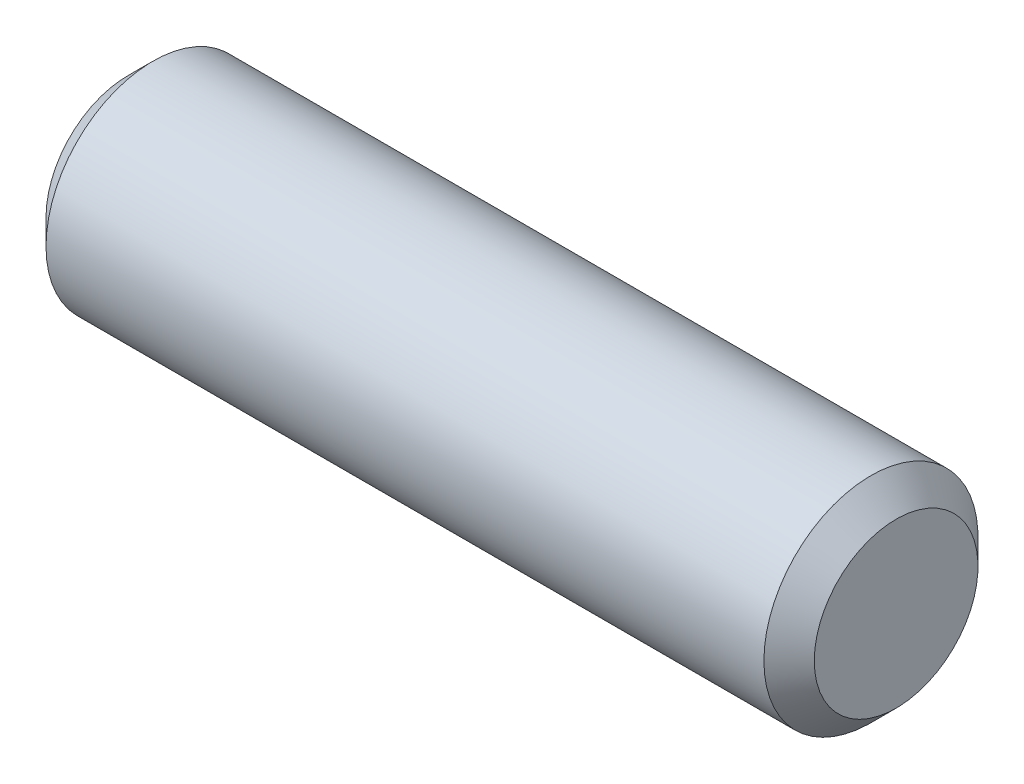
ISO-10303-21;
HEADER;
FILE_DESCRIPTION(('STEP AP214'),'2;1');
FILE_NAME('part.step','',(''),(''),'','','');
FILE_SCHEMA(('AUTOMOTIVE_DESIGN { 1 0 10303 214 1 1 1 1 }'));
ENDSEC;
DATA;
#1=APPLICATION_CONTEXT('core data for automotive mechanical design processes');
#2=APPLICATION_PROTOCOL_DEFINITION('international standard','automotive_design',2000,#1);
#3=PRODUCT_CONTEXT('',#1,'mechanical');
#4=PRODUCT('Part','Part','',(#3));
#5=PRODUCT_RELATED_PRODUCT_CATEGORY('part','',(#4));
#6=PRODUCT_DEFINITION_FORMATION('','',#4);
#7=PRODUCT_DEFINITION_CONTEXT('part definition',#1,'design');
#8=PRODUCT_DEFINITION('design','',#6,#7);
#9=PRODUCT_DEFINITION_SHAPE('','',#8);
#10=(LENGTH_UNIT() NAMED_UNIT(*) SI_UNIT(.MILLI.,.METRE.));
#11=(NAMED_UNIT(*) PLANE_ANGLE_UNIT() SI_UNIT($,.RADIAN.));
#12=(NAMED_UNIT(*) SI_UNIT($,.STERADIAN.) SOLID_ANGLE_UNIT());
#13=UNCERTAINTY_MEASURE_WITH_UNIT(LENGTH_MEASURE(1.E-05),#10,'distance_accuracy_value','');
#14=(GEOMETRIC_REPRESENTATION_CONTEXT(3) GLOBAL_UNCERTAINTY_ASSIGNED_CONTEXT((#13)) GLOBAL_UNIT_ASSIGNED_CONTEXT((#10,
#11,#12)) REPRESENTATION_CONTEXT('',''));
#15=CARTESIAN_POINT('',(0.,0.,0.));
#16=DIRECTION('',(0.,0.,1.));
#17=DIRECTION('',(1.,0.,0.));
#18=AXIS2_PLACEMENT_3D('',#15,#16,#17);
#19=CARTESIAN_POINT('',(0.,0.,0.));
#20=DIRECTION('',(1.,0.,0.));
#21=DIRECTION('',(0.,0.,-1.));
#22=AXIS2_PLACEMENT_3D('',#19,#20,#21);
#23=PLANE('',#22);
#24=CARTESIAN_POINT('',(0.,0.,0.));
#25=DIRECTION('',(-1.,0.,0.));
#26=DIRECTION('',(0.,0.,1.));
#27=AXIS2_PLACEMENT_3D('',#24,#25,#26);
#28=CIRCLE('',#27,0.8255);
#29=CARTESIAN_POINT('',(0.,0.,0.8255));
#30=VERTEX_POINT('',#29);
#31=EDGE_CURVE('E10',#30,#30,#28,.T.);
#32=ORIENTED_EDGE('',*,*,#31,.T.);
#33=EDGE_LOOP('',(#32));
#34=FACE_BOUND('',#33,.T.);
#35=ADVANCED_FACE('F33',(#34),#23,.F.);
#36=CARTESIAN_POINT('',(0.253999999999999,0.,0.));
#37=DIRECTION('',(1.,0.,0.));
#38=DIRECTION('',(0.,0.,-1.));
#39=AXIS2_PLACEMENT_3D('',#36,#37,#38);
#40=CONICAL_SURFACE('',#39,1.0795,0.78539816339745);
#41=ORIENTED_EDGE('',*,*,#31,.F.);
#42=EDGE_LOOP('',(#41));
#43=FACE_BOUND('',#42,.T.);
#44=CARTESIAN_POINT('',(0.253999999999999,0.,0.));
#45=DIRECTION('',(-1.,0.,0.));
#46=DIRECTION('',(0.,0.,1.));
#47=AXIS2_PLACEMENT_3D('',#44,#45,#46);
#48=CIRCLE('',#47,1.0795);
#49=CARTESIAN_POINT('',(0.253999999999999,0.,1.0795));
#50=VERTEX_POINT('',#49);
#51=EDGE_CURVE('E39',#50,#50,#48,.T.);
#52=ORIENTED_EDGE('',*,*,#51,.T.);
#53=EDGE_LOOP('',(#52));
#54=FACE_BOUND('',#53,.T.);
#55=ADVANCED_FACE('F65',(#43,#54),#40,.T.);
#56=CARTESIAN_POINT('',(0.,0.,0.));
#57=DIRECTION('',(-1.,0.,0.));
#58=DIRECTION('',(0.,0.,1.));
#59=AXIS2_PLACEMENT_3D('',#56,#57,#58);
#60=CYLINDRICAL_SURFACE('',#59,1.0795);
#61=ORIENTED_EDGE('',*,*,#51,.F.);
#62=EDGE_LOOP('',(#61));
#63=FACE_BOUND('',#62,.T.);
#64=CARTESIAN_POINT('',(7.493,0.,0.));
#65=DIRECTION('',(-1.,0.,0.));
#66=DIRECTION('',(0.,0.,1.));
#67=AXIS2_PLACEMENT_3D('',#64,#65,#66);
#68=CIRCLE('',#67,1.0795);
#69=CARTESIAN_POINT('',(7.493,0.,1.0795));
#70=VERTEX_POINT('',#69);
#71=EDGE_CURVE('E43',#70,#70,#68,.T.);
#72=ORIENTED_EDGE('',*,*,#71,.T.);
#73=EDGE_LOOP('',(#72));
#74=FACE_BOUND('',#73,.T.);
#75=ADVANCED_FACE('F61',(#63,#74),#60,.T.);
#76=CARTESIAN_POINT('',(7.747,0.,0.));
#77=DIRECTION('',(-1.,0.,0.));
#78=DIRECTION('',(0.,0.,1.));
#79=AXIS2_PLACEMENT_3D('',#76,#77,#78);
#80=CONICAL_SURFACE('',#79,0.8255,0.785398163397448);
#81=ORIENTED_EDGE('',*,*,#71,.F.);
#82=EDGE_LOOP('',(#81));
#83=FACE_BOUND('',#82,.T.);
#84=CARTESIAN_POINT('',(7.747,0.,0.));
#85=DIRECTION('',(-1.,0.,0.));
#86=DIRECTION('',(0.,0.,1.));
#87=AXIS2_PLACEMENT_3D('',#84,#85,#86);
#88=CIRCLE('',#87,0.8255);
#89=CARTESIAN_POINT('',(7.747,0.,0.8255));
#90=VERTEX_POINT('',#89);
#91=EDGE_CURVE('E47',#90,#90,#88,.T.);
#92=ORIENTED_EDGE('',*,*,#91,.T.);
#93=EDGE_LOOP('',(#92));
#94=FACE_BOUND('',#93,.T.);
#95=ADVANCED_FACE('F53',(#83,#94),#80,.T.);
#96=CARTESIAN_POINT('',(7.747,0.8255,0.));
#97=DIRECTION('',(-1.,0.,0.));
#98=DIRECTION('',(0.,0.,1.));
#99=AXIS2_PLACEMENT_3D('',#96,#97,#98);
#100=PLANE('',#99);
#101=ORIENTED_EDGE('',*,*,#91,.F.);
#102=EDGE_LOOP('',(#101));
#103=FACE_BOUND('',#102,.T.);
#104=ADVANCED_FACE('F55',(#103),#100,.F.);
#105=CLOSED_SHELL('',(#35,#55,#75,#95,#104));
#106=MANIFOLD_SOLID_BREP('B2',#105);
#107=ADVANCED_BREP_SHAPE_REPRESENTATION('',(#18,#106),#14);
#108=SHAPE_DEFINITION_REPRESENTATION(#9,#107);
ENDSEC;
END-ISO-10303-21;
